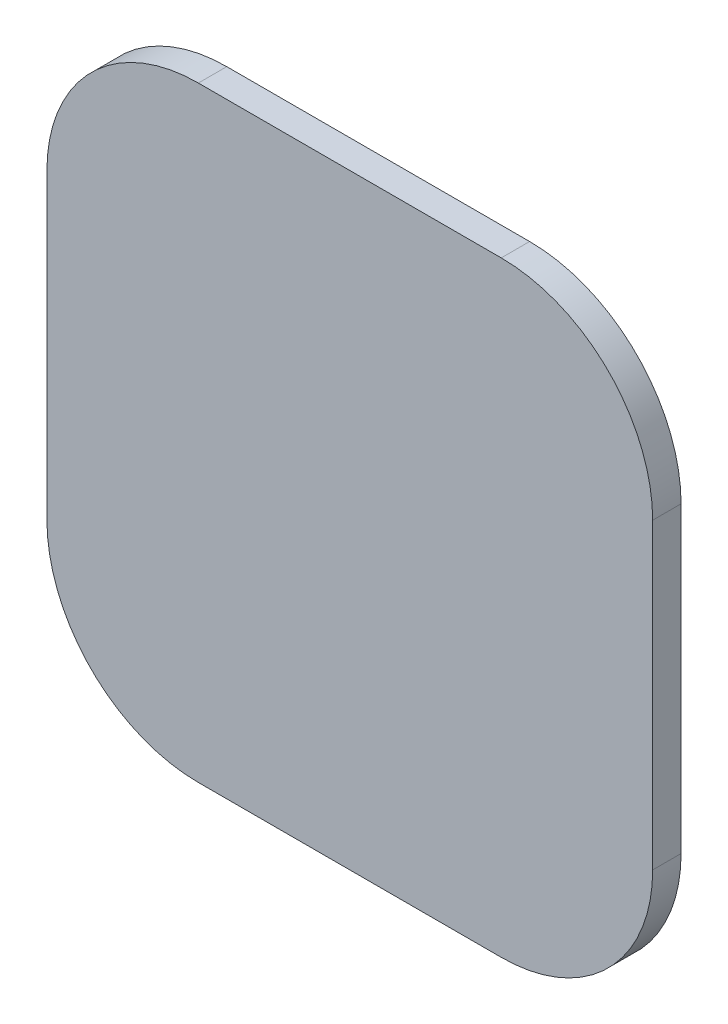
ISO-10303-21;
HEADER;
FILE_DESCRIPTION(('STEP AP214'),'2;1');
FILE_NAME('part.step','',(''),(''),'','','');
FILE_SCHEMA(('AUTOMOTIVE_DESIGN { 1 0 10303 214 1 1 1 1 }'));
ENDSEC;
DATA;
#1=APPLICATION_CONTEXT('core data for automotive mechanical design processes');
#2=APPLICATION_PROTOCOL_DEFINITION('international standard','automotive_design',2000,#1);
#3=PRODUCT_CONTEXT('',#1,'mechanical');
#4=PRODUCT('Part','Part','',(#3));
#5=PRODUCT_RELATED_PRODUCT_CATEGORY('part','',(#4));
#6=PRODUCT_DEFINITION_FORMATION('','',#4);
#7=PRODUCT_DEFINITION_CONTEXT('part definition',#1,'design');
#8=PRODUCT_DEFINITION('design','',#6,#7);
#9=PRODUCT_DEFINITION_SHAPE('','',#8);
#10=(LENGTH_UNIT() NAMED_UNIT(*) SI_UNIT(.MILLI.,.METRE.));
#11=(NAMED_UNIT(*) PLANE_ANGLE_UNIT() SI_UNIT($,.RADIAN.));
#12=(NAMED_UNIT(*) SI_UNIT($,.STERADIAN.) SOLID_ANGLE_UNIT());
#13=UNCERTAINTY_MEASURE_WITH_UNIT(LENGTH_MEASURE(1.E-05),#10,'distance_accuracy_value','');
#14=(GEOMETRIC_REPRESENTATION_CONTEXT(3) GLOBAL_UNCERTAINTY_ASSIGNED_CONTEXT((#13)) GLOBAL_UNIT_ASSIGNED_CONTEXT((#10,
#11,#12)) REPRESENTATION_CONTEXT('',''));
#15=CARTESIAN_POINT('',(0.,0.,0.));
#16=DIRECTION('',(0.,0.,1.));
#17=DIRECTION('',(1.,0.,0.));
#18=AXIS2_PLACEMENT_3D('',#15,#16,#17);
#19=CARTESIAN_POINT('',(-0.8128,-0.8128,0.));
#20=DIRECTION('',(0.,0.,1.));
#21=DIRECTION('',(1.,0.,0.));
#22=AXIS2_PLACEMENT_3D('',#19,#20,#21);
#23=PLANE('',#22);
#24=CARTESIAN_POINT('',(0.4064,-0.4064,0.));
#25=DIRECTION('',(0.,0.,1.));
#26=DIRECTION('',(1.,0.,0.));
#27=AXIS2_PLACEMENT_3D('',#24,#25,#26);
#28=CIRCLE('',#27,0.4064);
#29=CARTESIAN_POINT('',(0.40639975,-0.8128,0.));
#30=VERTEX_POINT('',#29);
#31=CARTESIAN_POINT('',(0.8128,-0.40639975,0.));
#32=VERTEX_POINT('',#31);
#33=EDGE_CURVE('E149',#30,#32,#28,.T.);
#34=ORIENTED_EDGE('',*,*,#33,.F.);
#35=CARTESIAN_POINT('',(-0.4064,-0.8128,0.));
#36=CARTESIAN_POINT('',(0.4064,-0.8128,0.));
#37=B_SPLINE_CURVE_WITH_KNOTS('',1,(#35,#36),.UNSPECIFIED.,.F.,.F.,(2,2),(0.,1.),.UNSPECIFIED.);
#38=CARTESIAN_POINT('',(-0.40639975,-0.8128,0.));
#39=VERTEX_POINT('',#38);
#40=EDGE_CURVE('E107',#39,#30,#37,.T.);
#41=ORIENTED_EDGE('',*,*,#40,.F.);
#42=CARTESIAN_POINT('',(-0.4064,-0.4064,0.));
#43=DIRECTION('',(0.,0.,1.));
#44=DIRECTION('',(1.,0.,0.));
#45=AXIS2_PLACEMENT_3D('',#42,#43,#44);
#46=CIRCLE('',#45,0.4064);
#47=CARTESIAN_POINT('',(-0.8128,-0.40639975,0.));
#48=VERTEX_POINT('',#47);
#49=EDGE_CURVE('E151',#48,#39,#46,.T.);
#50=ORIENTED_EDGE('',*,*,#49,.F.);
#51=CARTESIAN_POINT('',(-0.8128,0.4064,0.));
#52=CARTESIAN_POINT('',(-0.8128,-0.4064,0.));
#53=B_SPLINE_CURVE_WITH_KNOTS('',1,(#51,#52),.UNSPECIFIED.,.F.,.F.,(2,2),(0.,1.),.UNSPECIFIED.);
#54=CARTESIAN_POINT('',(-0.8128,0.40639975,0.));
#55=VERTEX_POINT('',#54);
#56=EDGE_CURVE('E117',#55,#48,#53,.T.);
#57=ORIENTED_EDGE('',*,*,#56,.F.);
#58=CARTESIAN_POINT('',(-0.4064,0.4064,0.));
#59=DIRECTION('',(0.,0.,1.));
#60=DIRECTION('',(1.,0.,0.));
#61=AXIS2_PLACEMENT_3D('',#58,#59,#60);
#62=CIRCLE('',#61,0.4064);
#63=CARTESIAN_POINT('',(-0.40639975,0.8128,0.));
#64=VERTEX_POINT('',#63);
#65=EDGE_CURVE('E153',#64,#55,#62,.T.);
#66=ORIENTED_EDGE('',*,*,#65,.F.);
#67=CARTESIAN_POINT('',(0.4064,0.8128,0.));
#68=CARTESIAN_POINT('',(-0.4064,0.8128,0.));
#69=B_SPLINE_CURVE_WITH_KNOTS('',1,(#67,#68),.UNSPECIFIED.,.F.,.F.,(2,2),(0.,1.),.UNSPECIFIED.);
#70=CARTESIAN_POINT('',(0.40639975,0.8128,0.));
#71=VERTEX_POINT('',#70);
#72=EDGE_CURVE('E85',#71,#64,#69,.T.);
#73=ORIENTED_EDGE('',*,*,#72,.F.);
#74=CARTESIAN_POINT('',(0.4064,0.4064,0.));
#75=DIRECTION('',(0.,0.,1.));
#76=DIRECTION('',(1.,0.,0.));
#77=AXIS2_PLACEMENT_3D('',#74,#75,#76);
#78=CIRCLE('',#77,0.4064);
#79=CARTESIAN_POINT('',(0.8128,0.4064,2.49999999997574E-07));
#80=VERTEX_POINT('',#79);
#81=EDGE_CURVE('E21',#80,#71,#78,.T.);
#82=ORIENTED_EDGE('',*,*,#81,.F.);
#83=CARTESIAN_POINT('',(0.8128,-0.4064,0.));
#84=CARTESIAN_POINT('',(0.8128,0.4064,0.));
#85=B_SPLINE_CURVE_WITH_KNOTS('',1,(#83,#84),.UNSPECIFIED.,.F.,.F.,(2,2),(0.,1.),.UNSPECIFIED.);
#86=EDGE_CURVE('E83',#32,#80,#85,.T.);
#87=ORIENTED_EDGE('',*,*,#86,.F.);
#88=EDGE_LOOP('',(#34,#41,#50,#57,#66,#73,#82,#87));
#89=FACE_BOUND('',#88,.T.);
#90=ADVANCED_FACE('F17',(#89),#23,.F.);
#91=CARTESIAN_POINT('',(0.8128,0.4064,0.0762));
#92=CARTESIAN_POINT('',(0.8128,0.4064,0.));
#93=B_SPLINE_CURVE_WITH_KNOTS('',1,(#91,#92),.UNSPECIFIED.,.F.,.F.,(2,2),(0.,1.),.UNSPECIFIED.);
#94=CARTESIAN_POINT('',(0.4064,0.4064,0.));
#95=DIRECTION('',(0.,0.,1.));
#96=AXIS1_PLACEMENT('',#94,#95);
#97=SURFACE_OF_REVOLUTION('',#93,#96);
#98=CARTESIAN_POINT('',(0.8128,0.4064,0.0762));
#99=CARTESIAN_POINT('',(0.8128,0.4064,0.));
#100=B_SPLINE_CURVE_WITH_KNOTS('',1,(#98,#99),.UNSPECIFIED.,.F.,.F.,(2,2),(0.,1.),.UNSPECIFIED.);
#101=CARTESIAN_POINT('',(0.8128,0.4064,0.0762));
#102=VERTEX_POINT('',#101);
#103=EDGE_CURVE('E89',#80,#102,#100,.F.);
#104=ORIENTED_EDGE('',*,*,#103,.F.);
#105=ORIENTED_EDGE('',*,*,#81,.T.);
#106=CARTESIAN_POINT('',(0.4064,0.8128,0.0762));
#107=CARTESIAN_POINT('',(0.4064,0.8128,0.));
#108=B_SPLINE_CURVE_WITH_KNOTS('',1,(#106,#107),.UNSPECIFIED.,.F.,.F.,(2,2),(0.,1.),.UNSPECIFIED.);
#109=CARTESIAN_POINT('',(0.4064,0.8128,0.0762));
#110=VERTEX_POINT('',#109);
#111=EDGE_CURVE('E133',#110,#71,#108,.T.);
#112=ORIENTED_EDGE('',*,*,#111,.F.);
#113=CARTESIAN_POINT('',(0.4064,0.4064,0.0762));
#114=DIRECTION('',(0.,0.,1.));
#115=DIRECTION('',(1.,0.,0.));
#116=AXIS2_PLACEMENT_3D('',#113,#114,#115);
#117=CIRCLE('',#116,0.4064);
#118=EDGE_CURVE('E92',#102,#110,#117,.T.);
#119=ORIENTED_EDGE('',*,*,#118,.F.);
#120=EDGE_LOOP('',(#104,#105,#112,#119));
#121=FACE_BOUND('',#120,.T.);
#122=ADVANCED_FACE('F90',(#121),#97,.F.);
#123=CARTESIAN_POINT('',(0.4064,0.8128,0.0762));
#124=DIRECTION('',(0.,1.,0.));
#125=DIRECTION('',(0.,0.,-1.));
#126=AXIS2_PLACEMENT_3D('',#123,#124,#125);
#127=PLANE('',#126);
#128=ORIENTED_EDGE('',*,*,#111,.T.);
#129=ORIENTED_EDGE('',*,*,#72,.T.);
#130=CARTESIAN_POINT('',(-0.4064,0.8128,0.0762));
#131=CARTESIAN_POINT('',(-0.4064,0.8128,0.));
#132=B_SPLINE_CURVE_WITH_KNOTS('',1,(#130,#131),.UNSPECIFIED.,.F.,.F.,(2,2),(0.,1.),.UNSPECIFIED.);
#133=CARTESIAN_POINT('',(-0.4064,0.8128,0.0762));
#134=VERTEX_POINT('',#133);
#135=EDGE_CURVE('E126',#134,#64,#132,.T.);
#136=ORIENTED_EDGE('',*,*,#135,.F.);
#137=DIRECTION('',(-1.,0.,0.));
#138=VECTOR('',#137,1.);
#139=CARTESIAN_POINT('',(0.,0.8128,0.0762));
#140=LINE('',#139,#138);
#141=EDGE_CURVE('E147',#110,#134,#140,.T.);
#142=ORIENTED_EDGE('',*,*,#141,.F.);
#143=EDGE_LOOP('',(#128,#129,#136,#142));
#144=FACE_BOUND('',#143,.T.);
#145=ADVANCED_FACE('F188',(#144),#127,.T.);
#146=CARTESIAN_POINT('',(-0.4064,0.8128,0.0762));
#147=CARTESIAN_POINT('',(-0.4064,0.8128,0.));
#148=B_SPLINE_CURVE_WITH_KNOTS('',1,(#146,#147),.UNSPECIFIED.,.F.,.F.,(2,2),(0.,1.),.UNSPECIFIED.);
#149=CARTESIAN_POINT('',(-0.4064,0.4064,0.));
#150=DIRECTION('',(0.,0.,1.));
#151=AXIS1_PLACEMENT('',#149,#150);
#152=SURFACE_OF_REVOLUTION('',#148,#151);
#153=ORIENTED_EDGE('',*,*,#135,.T.);
#154=ORIENTED_EDGE('',*,*,#65,.T.);
#155=CARTESIAN_POINT('',(-0.8128,0.4064,0.0762));
#156=CARTESIAN_POINT('',(-0.8128,0.4064,0.));
#157=B_SPLINE_CURVE_WITH_KNOTS('',1,(#155,#156),.UNSPECIFIED.,.F.,.F.,(2,2),(0.,1.),.UNSPECIFIED.);
#158=CARTESIAN_POINT('',(-0.8128,0.4064,0.0762));
#159=VERTEX_POINT('',#158);
#160=EDGE_CURVE('E125',#159,#55,#157,.T.);
#161=ORIENTED_EDGE('',*,*,#160,.F.);
#162=CARTESIAN_POINT('',(-0.4064,0.4064,0.0762));
#163=DIRECTION('',(0.,0.,1.));
#164=DIRECTION('',(1.,0.,0.));
#165=AXIS2_PLACEMENT_3D('',#162,#163,#164);
#166=CIRCLE('',#165,0.4064);
#167=EDGE_CURVE('E144',#134,#159,#166,.T.);
#168=ORIENTED_EDGE('',*,*,#167,.F.);
#169=EDGE_LOOP('',(#153,#154,#161,#168));
#170=FACE_BOUND('',#169,.T.);
#171=ADVANCED_FACE('F183',(#170),#152,.F.);
#172=CARTESIAN_POINT('',(-0.8128,0.4064,0.0762));
#173=DIRECTION('',(-1.,0.,0.));
#174=DIRECTION('',(0.,0.,-1.));
#175=AXIS2_PLACEMENT_3D('',#172,#173,#174);
#176=PLANE('',#175);
#177=ORIENTED_EDGE('',*,*,#160,.T.);
#178=ORIENTED_EDGE('',*,*,#56,.T.);
#179=CARTESIAN_POINT('',(-0.8128,-0.4064,0.0762));
#180=CARTESIAN_POINT('',(-0.8128,-0.4064,0.));
#181=B_SPLINE_CURVE_WITH_KNOTS('',1,(#179,#180),.UNSPECIFIED.,.F.,.F.,(2,2),(0.,1.),.UNSPECIFIED.);
#182=CARTESIAN_POINT('',(-0.8128,-0.4064,0.0762));
#183=VERTEX_POINT('',#182);
#184=EDGE_CURVE('E116',#183,#48,#181,.T.);
#185=ORIENTED_EDGE('',*,*,#184,.F.);
#186=DIRECTION('',(0.,-1.,0.));
#187=VECTOR('',#186,1.);
#188=CARTESIAN_POINT('',(-0.8128,0.,0.0762));
#189=LINE('',#188,#187);
#190=EDGE_CURVE('E143',#159,#183,#189,.T.);
#191=ORIENTED_EDGE('',*,*,#190,.F.);
#192=EDGE_LOOP('',(#177,#178,#185,#191));
#193=FACE_BOUND('',#192,.T.);
#194=ADVANCED_FACE('F187',(#193),#176,.T.);
#195=CARTESIAN_POINT('',(-0.8128,-0.4064,0.0762));
#196=CARTESIAN_POINT('',(-0.8128,-0.4064,0.));
#197=B_SPLINE_CURVE_WITH_KNOTS('',1,(#195,#196),.UNSPECIFIED.,.F.,.F.,(2,2),(0.,1.),.UNSPECIFIED.);
#198=CARTESIAN_POINT('',(-0.4064,-0.4064,0.));
#199=DIRECTION('',(0.,0.,1.));
#200=AXIS1_PLACEMENT('',#198,#199);
#201=SURFACE_OF_REVOLUTION('',#197,#200);
#202=ORIENTED_EDGE('',*,*,#184,.T.);
#203=ORIENTED_EDGE('',*,*,#49,.T.);
#204=CARTESIAN_POINT('',(-0.4064,-0.8128,0.0762));
#205=CARTESIAN_POINT('',(-0.4064,-0.8128,0.));
#206=B_SPLINE_CURVE_WITH_KNOTS('',1,(#204,#205),.UNSPECIFIED.,.F.,.F.,(2,2),(0.,1.),.UNSPECIFIED.);
#207=CARTESIAN_POINT('',(-0.4064,-0.8128,0.0762));
#208=VERTEX_POINT('',#207);
#209=EDGE_CURVE('E115',#208,#39,#206,.T.);
#210=ORIENTED_EDGE('',*,*,#209,.F.);
#211=CARTESIAN_POINT('',(-0.4064,-0.4064,0.0762));
#212=DIRECTION('',(0.,0.,1.));
#213=DIRECTION('',(1.,0.,0.));
#214=AXIS2_PLACEMENT_3D('',#211,#212,#213);
#215=CIRCLE('',#214,0.4064);
#216=EDGE_CURVE('E140',#183,#208,#215,.T.);
#217=ORIENTED_EDGE('',*,*,#216,.F.);
#218=EDGE_LOOP('',(#202,#203,#210,#217));
#219=FACE_BOUND('',#218,.T.);
#220=ADVANCED_FACE('F189',(#219),#201,.F.);
#221=CARTESIAN_POINT('',(-0.4064,-0.8128,0.0762));
#222=DIRECTION('',(0.,-1.,0.));
#223=DIRECTION('',(0.,0.,-1.));
#224=AXIS2_PLACEMENT_3D('',#221,#222,#223);
#225=PLANE('',#224);
#226=ORIENTED_EDGE('',*,*,#209,.T.);
#227=ORIENTED_EDGE('',*,*,#40,.T.);
#228=CARTESIAN_POINT('',(0.4064,-0.8128,0.0762));
#229=CARTESIAN_POINT('',(0.4064,-0.8128,0.));
#230=B_SPLINE_CURVE_WITH_KNOTS('',1,(#228,#229),.UNSPECIFIED.,.F.,.F.,(2,2),(0.,1.),.UNSPECIFIED.);
#231=CARTESIAN_POINT('',(0.4064,-0.8128,0.0762));
#232=VERTEX_POINT('',#231);
#233=EDGE_CURVE('E94',#232,#30,#230,.T.);
#234=ORIENTED_EDGE('',*,*,#233,.F.);
#235=DIRECTION('',(1.,0.,0.));
#236=VECTOR('',#235,1.);
#237=CARTESIAN_POINT('',(0.,-0.8128,0.0762));
#238=LINE('',#237,#236);
#239=EDGE_CURVE('E139',#208,#232,#238,.T.);
#240=ORIENTED_EDGE('',*,*,#239,.F.);
#241=EDGE_LOOP('',(#226,#227,#234,#240));
#242=FACE_BOUND('',#241,.T.);
#243=ADVANCED_FACE('F201',(#242),#225,.T.);
#244=CARTESIAN_POINT('',(0.4064,-0.8128,0.0762));
#245=CARTESIAN_POINT('',(0.4064,-0.8128,0.));
#246=B_SPLINE_CURVE_WITH_KNOTS('',1,(#244,#245),.UNSPECIFIED.,.F.,.F.,(2,2),(0.,1.),.UNSPECIFIED.);
#247=CARTESIAN_POINT('',(0.4064,-0.4064,0.));
#248=DIRECTION('',(0.,0.,1.));
#249=AXIS1_PLACEMENT('',#247,#248);
#250=SURFACE_OF_REVOLUTION('',#246,#249);
#251=ORIENTED_EDGE('',*,*,#233,.T.);
#252=ORIENTED_EDGE('',*,*,#33,.T.);
#253=CARTESIAN_POINT('',(0.8128,-0.4064,0.0762));
#254=CARTESIAN_POINT('',(0.8128,-0.4064,0.));
#255=B_SPLINE_CURVE_WITH_KNOTS('',1,(#253,#254),.UNSPECIFIED.,.F.,.F.,(2,2),(0.,1.),.UNSPECIFIED.);
#256=CARTESIAN_POINT('',(0.8128,-0.4064,0.0762));
#257=VERTEX_POINT('',#256);
#258=EDGE_CURVE('E36',#257,#32,#255,.T.);
#259=ORIENTED_EDGE('',*,*,#258,.F.);
#260=CARTESIAN_POINT('',(0.4064,-0.4064,0.0762));
#261=DIRECTION('',(0.,0.,1.));
#262=DIRECTION('',(1.,0.,0.));
#263=AXIS2_PLACEMENT_3D('',#260,#261,#262);
#264=CIRCLE('',#263,0.4064);
#265=EDGE_CURVE('E27',#232,#257,#264,.T.);
#266=ORIENTED_EDGE('',*,*,#265,.F.);
#267=EDGE_LOOP('',(#251,#252,#259,#266));
#268=FACE_BOUND('',#267,.T.);
#269=ADVANCED_FACE('F203',(#268),#250,.F.);
#270=CARTESIAN_POINT('',(0.8128,-0.4064,0.0762));
#271=DIRECTION('',(1.,0.,0.));
#272=DIRECTION('',(0.,0.,-1.));
#273=AXIS2_PLACEMENT_3D('',#270,#271,#272);
#274=PLANE('',#273);
#275=ORIENTED_EDGE('',*,*,#258,.T.);
#276=ORIENTED_EDGE('',*,*,#86,.T.);
#277=ORIENTED_EDGE('',*,*,#103,.T.);
#278=DIRECTION('',(0.,1.,0.));
#279=VECTOR('',#278,1.);
#280=CARTESIAN_POINT('',(0.8128,0.,0.0762));
#281=LINE('',#280,#279);
#282=EDGE_CURVE('E11',#257,#102,#281,.T.);
#283=ORIENTED_EDGE('',*,*,#282,.F.);
#284=EDGE_LOOP('',(#275,#276,#277,#283));
#285=FACE_BOUND('',#284,.T.);
#286=ADVANCED_FACE('F96',(#285),#274,.T.);
#287=CARTESIAN_POINT('',(-0.8128,-0.8128,0.0762));
#288=DIRECTION('',(0.,0.,1.));
#289=DIRECTION('',(1.,0.,0.));
#290=AXIS2_PLACEMENT_3D('',#287,#288,#289);
#291=PLANE('',#290);
#292=ORIENTED_EDGE('',*,*,#265,.T.);
#293=ORIENTED_EDGE('',*,*,#282,.T.);
#294=ORIENTED_EDGE('',*,*,#118,.T.);
#295=ORIENTED_EDGE('',*,*,#141,.T.);
#296=ORIENTED_EDGE('',*,*,#167,.T.);
#297=ORIENTED_EDGE('',*,*,#190,.T.);
#298=ORIENTED_EDGE('',*,*,#216,.T.);
#299=ORIENTED_EDGE('',*,*,#239,.T.);
#300=EDGE_LOOP('',(#292,#293,#294,#295,#296,#297,#298,#299));
#301=FACE_BOUND('',#300,.T.);
#302=ADVANCED_FACE('F19',(#301),#291,.T.);
#303=CLOSED_SHELL('',(#90,#122,#145,#171,#194,#220,#243,#269,#286,#302));
#304=MANIFOLD_SOLID_BREP('B1',#303);
#305=ADVANCED_BREP_SHAPE_REPRESENTATION('',(#18,#304),#14);
#306=SHAPE_DEFINITION_REPRESENTATION(#9,#305);
ENDSEC;
END-ISO-10303-21;
